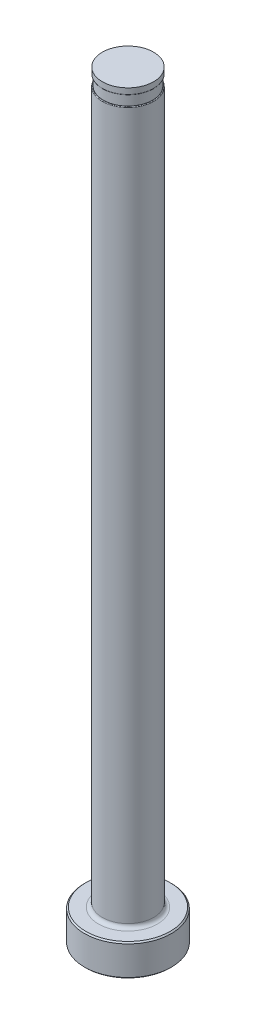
from build123d import *

# Parameters (mm, degrees)
CHAMFER1_SIZE     = 0.254
FILLET1_R         = 0.762
SKETCH2_W         = 0.2032
SKETCH2_H         = 2.032
D_SLOT_DEPTH      = 153.898684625
D_SLOT_DEPTH_BACK = 153.898684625
SKETCH5_W         = 0.0127
SKETCH5_H         = 1.27
FILLET2_R         = 0.127


with BuildPart() as part:
    # Sketch1 → Revolve1 (revolve)
    with BuildSketch(Plane.XY, mode=Mode.PRIVATE) as revolve1_sk:
        Polygon((0, 0), (-8.7249, 0), (-8.7249, 6.35), (-5.15874, 6.35), (-5.15874, 152.4), (0, 152.4), align=None)
    revolve(revolve1_sk.sketch.rotate(Axis((0, 259.958771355, 0), (0, -1, 0)), 270), axis=Axis((0, 259.958771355, 0), (0, -1, 0)))

    # Chamfer1
    chamfer1_edges = [part.edges().sort_by_distance(p)[0] for p in [
        (0, 6.35, -8.7249),
        (0, 0, -8.7249),
    ]]
    chamfer(chamfer1_edges, length=CHAMFER1_SIZE)

    # Fillet1
    fillet1_edges = [part.edges().sort_by_distance(p)[0] for p in [
        (0, 6.35, -5.15874),
    ]]
    fillet(fillet1_edges, radius=FILLET1_R)

    # Sketch2 → Vent Relief (revolve, cut)
    with BuildSketch(Plane.XY, mode=Mode.PRIVATE) as vent_relief_sk:
        with Locations((-5.05714, 150.114)):
            Rectangle(SKETCH2_W, SKETCH2_H)
    revolve(vent_relief_sk.sketch.rotate(Axis((0, 153.448281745, 0), (0, -1, 0)), 270), axis=Axis((0, 153.448281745, 0), (0, -1, 0)), mode=Mode.SUBTRACT)

    # Sketch3 → D-Slot (cut, two sides: drawn at the far end of the back side and taken through both)
    with BuildSketch(Plane.XY.offset(-D_SLOT_DEPTH_BACK)):
        with BuildLine():
            Line((-4.95554, 150.114), (-4.95554, 86.614))
            ThreePointArc((-4.95554, 86.614), (-5.006753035, 86.046038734), (-5.15874, 85.4964))
            Line((-5.15874, 85.4964), (-5.15874, 150.114))
            Line((-5.15874, 150.114), (-4.95554, 150.114))
        make_face()
    extrude(amount=D_SLOT_DEPTH + D_SLOT_DEPTH_BACK, mode=Mode.SUBTRACT)

    # Sketch5 → Vent Diameter (revolve, cut)
    with BuildSketch(Plane.XY, mode=Mode.PRIVATE) as vent_diameter_sk:
        with Locations((-5.15239, 151.765)):
            Rectangle(SKETCH5_W, SKETCH5_H)
    revolve(vent_diameter_sk.sketch.rotate(Axis((0, 152.687735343, 0), (0, -1, 0)), 90), axis=Axis((0, 152.687735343, 0), (0, -1, 0)), mode=Mode.SUBTRACT)

    # Fillet2
    fillet2_edges = [part.edges().sort_by_distance(p)[0] for p in [
        (4.123602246, 149.098, -3.099758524),
        (0, 151.13, 5.14604),
    ]]
    fillet(fillet2_edges, radius=FILLET2_R)


solid = part.part
